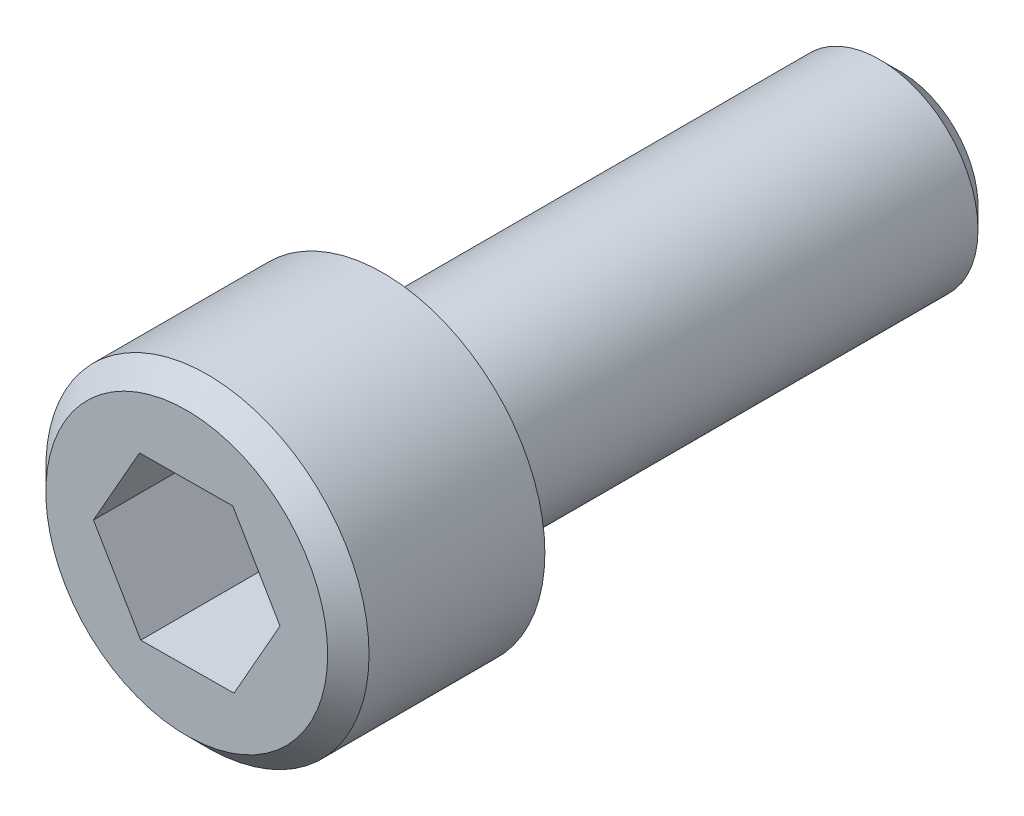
ISO-10303-21;
HEADER;
FILE_DESCRIPTION(('STEP AP214'),'2;1');
FILE_NAME('part.step','',(''),(''),'','','');
FILE_SCHEMA(('AUTOMOTIVE_DESIGN { 1 0 10303 214 1 1 1 1 }'));
ENDSEC;
DATA;
#1=APPLICATION_CONTEXT('core data for automotive mechanical design processes');
#2=APPLICATION_PROTOCOL_DEFINITION('international standard','automotive_design',2000,#1);
#3=PRODUCT_CONTEXT('',#1,'mechanical');
#4=PRODUCT('Part','Part','',(#3));
#5=PRODUCT_RELATED_PRODUCT_CATEGORY('part','',(#4));
#6=PRODUCT_DEFINITION_FORMATION('','',#4);
#7=PRODUCT_DEFINITION_CONTEXT('part definition',#1,'design');
#8=PRODUCT_DEFINITION('design','',#6,#7);
#9=PRODUCT_DEFINITION_SHAPE('','',#8);
#10=(LENGTH_UNIT() NAMED_UNIT(*) SI_UNIT(.MILLI.,.METRE.));
#11=(NAMED_UNIT(*) PLANE_ANGLE_UNIT() SI_UNIT($,.RADIAN.));
#12=(NAMED_UNIT(*) SI_UNIT($,.STERADIAN.) SOLID_ANGLE_UNIT());
#13=UNCERTAINTY_MEASURE_WITH_UNIT(LENGTH_MEASURE(1.E-05),#10,'distance_accuracy_value','');
#14=(GEOMETRIC_REPRESENTATION_CONTEXT(3) GLOBAL_UNCERTAINTY_ASSIGNED_CONTEXT((#13)) GLOBAL_UNIT_ASSIGNED_CONTEXT((#10,
#11,#12)) REPRESENTATION_CONTEXT('',''));
#15=CARTESIAN_POINT('',(0.,0.,0.));
#16=DIRECTION('',(0.,0.,1.));
#17=DIRECTION('',(1.,0.,0.));
#18=AXIS2_PLACEMENT_3D('',#15,#16,#17);
#19=CARTESIAN_POINT('',(0.,0.,0.));
#20=DIRECTION('',(0.,0.,1.));
#21=DIRECTION('',(1.,0.,0.));
#22=AXIS2_PLACEMENT_3D('',#19,#20,#21);
#23=PLANE('',#22);
#24=CARTESIAN_POINT('',(0.,0.,0.));
#25=DIRECTION('',(0.,0.,1.));
#26=DIRECTION('',(1.,0.,0.));
#27=AXIS2_PLACEMENT_3D('',#24,#25,#26);
#28=CIRCLE('',#27,3.96875);
#29=CARTESIAN_POINT('',(3.96875,0.,0.));
#30=VERTEX_POINT('',#29);
#31=EDGE_CURVE('E138',#30,#30,#28,.T.);
#32=ORIENTED_EDGE('',*,*,#31,.F.);
#33=EDGE_LOOP('',(#32));
#34=FACE_BOUND('',#33,.T.);
#35=CARTESIAN_POINT('',(0.,0.,0.));
#36=DIRECTION('',(0.,0.,1.));
#37=DIRECTION('',(1.,0.,0.));
#38=AXIS2_PLACEMENT_3D('',#35,#36,#37);
#39=CIRCLE('',#38,2.413);
#40=CARTESIAN_POINT('',(2.413,0.,0.));
#41=VERTEX_POINT('',#40);
#42=EDGE_CURVE('E153',#41,#41,#39,.F.);
#43=ORIENTED_EDGE('',*,*,#42,.F.);
#44=EDGE_LOOP('',(#43));
#45=FACE_BOUND('',#44,.T.);
#46=ADVANCED_FACE('F35',(#34,#45),#23,.F.);
#47=CARTESIAN_POINT('',(0.,0.,4.826));
#48=DIRECTION('',(0.,0.,-1.));
#49=DIRECTION('',(-1.,0.,0.));
#50=AXIS2_PLACEMENT_3D('',#47,#48,#49);
#51=CYLINDRICAL_SURFACE('',#50,3.96875);
#52=CARTESIAN_POINT('',(0.,0.,4.318));
#53=DIRECTION('',(0.,0.,1.));
#54=DIRECTION('',(1.,0.,0.));
#55=AXIS2_PLACEMENT_3D('',#52,#53,#54);
#56=CIRCLE('',#55,3.96875);
#57=CARTESIAN_POINT('',(3.96875,0.,4.318));
#58=VERTEX_POINT('',#57);
#59=EDGE_CURVE('E150',#58,#58,#56,.F.);
#60=ORIENTED_EDGE('',*,*,#59,.T.);
#61=EDGE_LOOP('',(#60));
#62=FACE_BOUND('',#61,.T.);
#63=ORIENTED_EDGE('',*,*,#31,.T.);
#64=EDGE_LOOP('',(#63));
#65=FACE_BOUND('',#64,.T.);
#66=ADVANCED_FACE('F37',(#62,#65),#51,.T.);
#67=CARTESIAN_POINT('',(0.,0.,4.826));
#68=DIRECTION('',(0.,0.,1.));
#69=DIRECTION('',(1.,0.,0.));
#70=AXIS2_PLACEMENT_3D('',#67,#68,#69);
#71=PLANE('',#70);
#72=DIRECTION('',(0.506642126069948,-0.862156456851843,0.));
#73=VECTOR('',#72,1.);
#74=CARTESIAN_POINT('',(-2.2905579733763,-0.0176074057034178,4.826));
#75=LINE('',#74,#73);
#76=CARTESIAN_POINT('',(-2.2905579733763,-0.0176074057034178,4.826));
#77=VERTEX_POINT('',#76);
#78=CARTESIAN_POINT('',(-1.13003052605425,-1.99248509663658,4.826));
#79=VERTEX_POINT('',#78);
#80=EDGE_CURVE('E50',#77,#79,#75,.T.);
#81=ORIENTED_EDGE('',*,*,#80,.F.);
#82=DIRECTION('',(-0.493328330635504,-0.869843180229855,0.));
#83=VECTOR('',#82,1.);
#84=CARTESIAN_POINT('',(-1.16052744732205,1.97487769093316,4.826));
#85=LINE('',#84,#83);
#86=CARTESIAN_POINT('',(-1.16052744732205,1.97487769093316,4.826));
#87=VERTEX_POINT('',#86);
#88=EDGE_CURVE('E120',#87,#77,#85,.T.);
#89=ORIENTED_EDGE('',*,*,#88,.F.);
#90=DIRECTION('',(-0.999970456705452,-0.00768672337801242,0.));
#91=VECTOR('',#90,1.);
#92=CARTESIAN_POINT('',(1.13003052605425,1.99248509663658,4.826));
#93=LINE('',#92,#91);
#94=CARTESIAN_POINT('',(1.13003052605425,1.99248509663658,4.826));
#95=VERTEX_POINT('',#94);
#96=EDGE_CURVE('E114',#95,#87,#93,.T.);
#97=ORIENTED_EDGE('',*,*,#96,.F.);
#98=DIRECTION('',(-0.506642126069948,0.862156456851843,0.));
#99=VECTOR('',#98,1.);
#100=CARTESIAN_POINT('',(2.2905579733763,0.0176074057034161,4.826));
#101=LINE('',#100,#99);
#102=CARTESIAN_POINT('',(2.2905579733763,0.0176074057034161,4.826));
#103=VERTEX_POINT('',#102);
#104=EDGE_CURVE('E112',#103,#95,#101,.T.);
#105=ORIENTED_EDGE('',*,*,#104,.F.);
#106=DIRECTION('',(0.493328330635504,0.869843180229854,0.));
#107=VECTOR('',#106,1.);
#108=CARTESIAN_POINT('',(1.16052744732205,-1.97487769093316,4.826));
#109=LINE('',#108,#107);
#110=CARTESIAN_POINT('',(1.16052744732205,-1.97487769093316,4.826));
#111=VERTEX_POINT('',#110);
#112=EDGE_CURVE('E93',#111,#103,#109,.T.);
#113=ORIENTED_EDGE('',*,*,#112,.F.);
#114=DIRECTION('',(0.999970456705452,0.00768672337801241,0.));
#115=VECTOR('',#114,1.);
#116=CARTESIAN_POINT('',(-1.13003052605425,-1.99248509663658,4.826));
#117=LINE('',#116,#115);
#118=EDGE_CURVE('E104',#79,#111,#117,.T.);
#119=ORIENTED_EDGE('',*,*,#118,.F.);
#120=EDGE_LOOP('',(#81,#89,#97,#105,#113,#119));
#121=FACE_BOUND('',#120,.T.);
#122=CARTESIAN_POINT('',(0.,0.,4.826));
#123=DIRECTION('',(0.,0.,1.));
#124=DIRECTION('',(1.,0.,0.));
#125=AXIS2_PLACEMENT_3D('',#122,#123,#124);
#126=CIRCLE('',#125,3.46075);
#127=CARTESIAN_POINT('',(3.46075,0.,4.826));
#128=VERTEX_POINT('',#127);
#129=EDGE_CURVE('E147',#128,#128,#126,.T.);
#130=ORIENTED_EDGE('',*,*,#129,.T.);
#131=EDGE_LOOP('',(#130));
#132=FACE_BOUND('',#131,.T.);
#133=ADVANCED_FACE('F108',(#121,#132),#71,.T.);
#134=CARTESIAN_POINT('',(0.,0.,4.826));
#135=DIRECTION('',(0.,0.,-1.));
#136=DIRECTION('',(-1.,0.,0.));
#137=AXIS2_PLACEMENT_3D('',#134,#135,#136);
#138=CONICAL_SURFACE('',#137,3.46075,0.785398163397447);
#139=ORIENTED_EDGE('',*,*,#59,.F.);
#140=EDGE_LOOP('',(#139));
#141=FACE_BOUND('',#140,.T.);
#142=ORIENTED_EDGE('',*,*,#129,.F.);
#143=EDGE_LOOP('',(#142));
#144=FACE_BOUND('',#143,.T.);
#145=ADVANCED_FACE('F180',(#141,#144),#138,.T.);
#146=CARTESIAN_POINT('',(-2.2905579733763,-0.0176074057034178,1.651));
#147=DIRECTION('',(-0.862156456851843,-0.506642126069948,0.));
#148=DIRECTION('',(0.506642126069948,-0.862156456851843,0.));
#149=AXIS2_PLACEMENT_3D('',#146,#147,#148);
#150=PLANE('',#149);
#151=ORIENTED_EDGE('',*,*,#80,.T.);
#152=DIRECTION('',(0.,0.,1.));
#153=VECTOR('',#152,1.);
#154=CARTESIAN_POINT('',(-1.13003052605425,-1.99248509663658,1.651));
#155=LINE('',#154,#153);
#156=CARTESIAN_POINT('',(-1.13003052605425,-1.99248509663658,1.651));
#157=VERTEX_POINT('',#156);
#158=EDGE_CURVE('E101',#157,#79,#155,.T.);
#159=ORIENTED_EDGE('',*,*,#158,.F.);
#160=DIRECTION('',(0.506642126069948,-0.862156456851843,0.));
#161=VECTOR('',#160,1.);
#162=CARTESIAN_POINT('',(-2.2905579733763,-0.0176074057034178,1.651));
#163=LINE('',#162,#161);
#164=CARTESIAN_POINT('',(-2.2905579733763,-0.0176074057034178,1.651));
#165=VERTEX_POINT('',#164);
#166=EDGE_CURVE('E122',#165,#157,#163,.T.);
#167=ORIENTED_EDGE('',*,*,#166,.F.);
#168=DIRECTION('',(0.,0.,1.));
#169=VECTOR('',#168,1.);
#170=CARTESIAN_POINT('',(-2.2905579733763,-0.0176074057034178,1.651));
#171=LINE('',#170,#169);
#172=EDGE_CURVE('E57',#165,#77,#171,.T.);
#173=ORIENTED_EDGE('',*,*,#172,.T.);
#174=EDGE_LOOP('',(#151,#159,#167,#173));
#175=FACE_BOUND('',#174,.T.);
#176=ADVANCED_FACE('F186',(#175),#150,.F.);
#177=CARTESIAN_POINT('',(-1.16052744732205,1.97487769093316,1.651));
#178=DIRECTION('',(-0.869843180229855,0.493328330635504,0.));
#179=DIRECTION('',(-0.493328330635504,-0.869843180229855,0.));
#180=AXIS2_PLACEMENT_3D('',#177,#178,#179);
#181=PLANE('',#180);
#182=ORIENTED_EDGE('',*,*,#88,.T.);
#183=ORIENTED_EDGE('',*,*,#172,.F.);
#184=DIRECTION('',(-0.493328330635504,-0.869843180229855,0.));
#185=VECTOR('',#184,1.);
#186=CARTESIAN_POINT('',(-1.16052744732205,1.97487769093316,1.651));
#187=LINE('',#186,#185);
#188=CARTESIAN_POINT('',(-1.16052744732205,1.97487769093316,1.651));
#189=VERTEX_POINT('',#188);
#190=EDGE_CURVE('E134',#189,#165,#187,.T.);
#191=ORIENTED_EDGE('',*,*,#190,.F.);
#192=DIRECTION('',(0.,0.,1.));
#193=VECTOR('',#192,1.);
#194=CARTESIAN_POINT('',(-1.16052744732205,1.97487769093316,1.651));
#195=LINE('',#194,#193);
#196=EDGE_CURVE('E139',#189,#87,#195,.T.);
#197=ORIENTED_EDGE('',*,*,#196,.T.);
#198=EDGE_LOOP('',(#182,#183,#191,#197));
#199=FACE_BOUND('',#198,.T.);
#200=ADVANCED_FACE('F191',(#199),#181,.F.);
#201=CARTESIAN_POINT('',(1.13003052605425,1.99248509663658,1.651));
#202=DIRECTION('',(-0.00768672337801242,0.999970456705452,0.));
#203=DIRECTION('',(-0.999970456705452,-0.00768672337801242,0.));
#204=AXIS2_PLACEMENT_3D('',#201,#202,#203);
#205=PLANE('',#204);
#206=ORIENTED_EDGE('',*,*,#96,.T.);
#207=ORIENTED_EDGE('',*,*,#196,.F.);
#208=DIRECTION('',(-0.999970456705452,-0.00768672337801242,0.));
#209=VECTOR('',#208,1.);
#210=CARTESIAN_POINT('',(1.13003052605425,1.99248509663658,1.651));
#211=LINE('',#210,#209);
#212=CARTESIAN_POINT('',(1.13003052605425,1.99248509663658,1.651));
#213=VERTEX_POINT('',#212);
#214=EDGE_CURVE('E131',#213,#189,#211,.T.);
#215=ORIENTED_EDGE('',*,*,#214,.F.);
#216=DIRECTION('',(0.,0.,1.));
#217=VECTOR('',#216,1.);
#218=CARTESIAN_POINT('',(1.13003052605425,1.99248509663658,1.651));
#219=LINE('',#218,#217);
#220=EDGE_CURVE('E141',#213,#95,#219,.T.);
#221=ORIENTED_EDGE('',*,*,#220,.T.);
#222=EDGE_LOOP('',(#206,#207,#215,#221));
#223=FACE_BOUND('',#222,.T.);
#224=ADVANCED_FACE('F199',(#223),#205,.F.);
#225=CARTESIAN_POINT('',(2.2905579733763,0.0176074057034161,1.651));
#226=DIRECTION('',(0.862156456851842,0.506642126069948,0.));
#227=DIRECTION('',(-0.506642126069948,0.862156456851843,0.));
#228=AXIS2_PLACEMENT_3D('',#225,#226,#227);
#229=PLANE('',#228);
#230=ORIENTED_EDGE('',*,*,#104,.T.);
#231=ORIENTED_EDGE('',*,*,#220,.F.);
#232=DIRECTION('',(-0.506642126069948,0.862156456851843,0.));
#233=VECTOR('',#232,1.);
#234=CARTESIAN_POINT('',(2.2905579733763,0.0176074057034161,1.651));
#235=LINE('',#234,#233);
#236=CARTESIAN_POINT('',(2.2905579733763,0.0176074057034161,1.651));
#237=VERTEX_POINT('',#236);
#238=EDGE_CURVE('E128',#237,#213,#235,.T.);
#239=ORIENTED_EDGE('',*,*,#238,.F.);
#240=DIRECTION('',(0.,0.,1.));
#241=VECTOR('',#240,1.);
#242=CARTESIAN_POINT('',(2.2905579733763,0.0176074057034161,1.651));
#243=LINE('',#242,#241);
#244=EDGE_CURVE('E100',#237,#103,#243,.T.);
#245=ORIENTED_EDGE('',*,*,#244,.T.);
#246=EDGE_LOOP('',(#230,#231,#239,#245));
#247=FACE_BOUND('',#246,.T.);
#248=ADVANCED_FACE('F207',(#247),#229,.F.);
#249=CARTESIAN_POINT('',(1.16052744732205,-1.97487769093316,1.651));
#250=DIRECTION('',(0.869843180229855,-0.493328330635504,0.));
#251=DIRECTION('',(0.493328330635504,0.869843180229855,0.));
#252=AXIS2_PLACEMENT_3D('',#249,#250,#251);
#253=PLANE('',#252);
#254=ORIENTED_EDGE('',*,*,#112,.T.);
#255=ORIENTED_EDGE('',*,*,#244,.F.);
#256=DIRECTION('',(0.493328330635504,0.869843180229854,0.));
#257=VECTOR('',#256,1.);
#258=CARTESIAN_POINT('',(1.16052744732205,-1.97487769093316,1.651));
#259=LINE('',#258,#257);
#260=CARTESIAN_POINT('',(1.16052744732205,-1.97487769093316,1.651));
#261=VERTEX_POINT('',#260);
#262=EDGE_CURVE('E96',#261,#237,#259,.T.);
#263=ORIENTED_EDGE('',*,*,#262,.F.);
#264=DIRECTION('',(0.,0.,1.));
#265=VECTOR('',#264,1.);
#266=CARTESIAN_POINT('',(1.16052744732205,-1.97487769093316,1.651));
#267=LINE('',#266,#265);
#268=EDGE_CURVE('E89',#261,#111,#267,.T.);
#269=ORIENTED_EDGE('',*,*,#268,.T.);
#270=EDGE_LOOP('',(#254,#255,#263,#269));
#271=FACE_BOUND('',#270,.T.);
#272=ADVANCED_FACE('F91',(#271),#253,.F.);
#273=CARTESIAN_POINT('',(-1.13003052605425,-1.99248509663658,1.651));
#274=DIRECTION('',(0.00768672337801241,-0.999970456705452,0.));
#275=DIRECTION('',(0.999970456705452,0.00768672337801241,0.));
#276=AXIS2_PLACEMENT_3D('',#273,#274,#275);
#277=PLANE('',#276);
#278=ORIENTED_EDGE('',*,*,#118,.T.);
#279=ORIENTED_EDGE('',*,*,#268,.F.);
#280=DIRECTION('',(0.999970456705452,0.00768672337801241,0.));
#281=VECTOR('',#280,1.);
#282=CARTESIAN_POINT('',(-1.13003052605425,-1.99248509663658,1.651));
#283=LINE('',#282,#281);
#284=EDGE_CURVE('E125',#157,#261,#283,.T.);
#285=ORIENTED_EDGE('',*,*,#284,.F.);
#286=ORIENTED_EDGE('',*,*,#158,.T.);
#287=EDGE_LOOP('',(#278,#279,#285,#286));
#288=FACE_BOUND('',#287,.T.);
#289=ADVANCED_FACE('F105',(#288),#277,.F.);
#290=CARTESIAN_POINT('',(-1.13003052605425,-1.99248509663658,1.651));
#291=DIRECTION('',(0.,0.,1.));
#292=DIRECTION('',(1.,0.,0.));
#293=AXIS2_PLACEMENT_3D('',#290,#291,#292);
#294=PLANE('',#293);
#295=ORIENTED_EDGE('',*,*,#166,.T.);
#296=ORIENTED_EDGE('',*,*,#284,.T.);
#297=ORIENTED_EDGE('',*,*,#262,.T.);
#298=ORIENTED_EDGE('',*,*,#238,.T.);
#299=ORIENTED_EDGE('',*,*,#214,.T.);
#300=ORIENTED_EDGE('',*,*,#190,.T.);
#301=EDGE_LOOP('',(#295,#296,#297,#298,#299,#300));
#302=FACE_BOUND('',#301,.T.);
#303=ADVANCED_FACE('F204',(#302),#294,.T.);
#304=CARTESIAN_POINT('',(0.,0.,-12.7));
#305=DIRECTION('',(0.,0.,1.));
#306=DIRECTION('',(1.,0.,0.));
#307=AXIS2_PLACEMENT_3D('',#304,#305,#306);
#308=CYLINDRICAL_SURFACE('',#307,2.413);
#309=CARTESIAN_POINT('',(0.,0.,-12.192));
#310=DIRECTION('',(0.,0.,-1.));
#311=DIRECTION('',(-1.,0.,0.));
#312=AXIS2_PLACEMENT_3D('',#309,#310,#311);
#313=CIRCLE('',#312,2.413);
#314=CARTESIAN_POINT('',(-2.413,0.,-12.192));
#315=VERTEX_POINT('',#314);
#316=EDGE_CURVE('E12',#315,#315,#313,.F.);
#317=ORIENTED_EDGE('',*,*,#316,.T.);
#318=EDGE_LOOP('',(#317));
#319=FACE_BOUND('',#318,.T.);
#320=ORIENTED_EDGE('',*,*,#42,.T.);
#321=EDGE_LOOP('',(#320));
#322=FACE_BOUND('',#321,.T.);
#323=ADVANCED_FACE('F167',(#319,#322),#308,.T.);
#324=CARTESIAN_POINT('',(0.,0.,-12.7));
#325=DIRECTION('',(0.,0.,-1.));
#326=DIRECTION('',(-1.,0.,0.));
#327=AXIS2_PLACEMENT_3D('',#324,#325,#326);
#328=PLANE('',#327);
#329=CARTESIAN_POINT('',(0.,0.,-12.7));
#330=DIRECTION('',(0.,0.,-1.));
#331=DIRECTION('',(-1.,0.,0.));
#332=AXIS2_PLACEMENT_3D('',#329,#330,#331);
#333=CIRCLE('',#332,1.905);
#334=CARTESIAN_POINT('',(-1.905,0.,-12.7));
#335=VERTEX_POINT('',#334);
#336=EDGE_CURVE('E43',#335,#335,#333,.T.);
#337=ORIENTED_EDGE('',*,*,#336,.T.);
#338=EDGE_LOOP('',(#337));
#339=FACE_BOUND('',#338,.T.);
#340=ADVANCED_FACE('F158',(#339),#328,.T.);
#341=CARTESIAN_POINT('',(0.,0.,-12.7));
#342=DIRECTION('',(0.,0.,1.));
#343=DIRECTION('',(1.,0.,0.));
#344=AXIS2_PLACEMENT_3D('',#341,#342,#343);
#345=CONICAL_SURFACE('',#344,1.905,0.785398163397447);
#346=ORIENTED_EDGE('',*,*,#316,.F.);
#347=EDGE_LOOP('',(#346));
#348=FACE_BOUND('',#347,.T.);
#349=ORIENTED_EDGE('',*,*,#336,.F.);
#350=EDGE_LOOP('',(#349));
#351=FACE_BOUND('',#350,.T.);
#352=ADVANCED_FACE('F160',(#348,#351),#345,.T.);
#353=CLOSED_SHELL('',(#46,#66,#133,#145,#176,#200,#224,#248,#272,#289,#303,#323,#340,#352));
#354=MANIFOLD_SOLID_BREP('B2',#353);
#355=ADVANCED_BREP_SHAPE_REPRESENTATION('',(#18,#354),#14);
#356=SHAPE_DEFINITION_REPRESENTATION(#9,#355);
ENDSEC;
END-ISO-10303-21;
